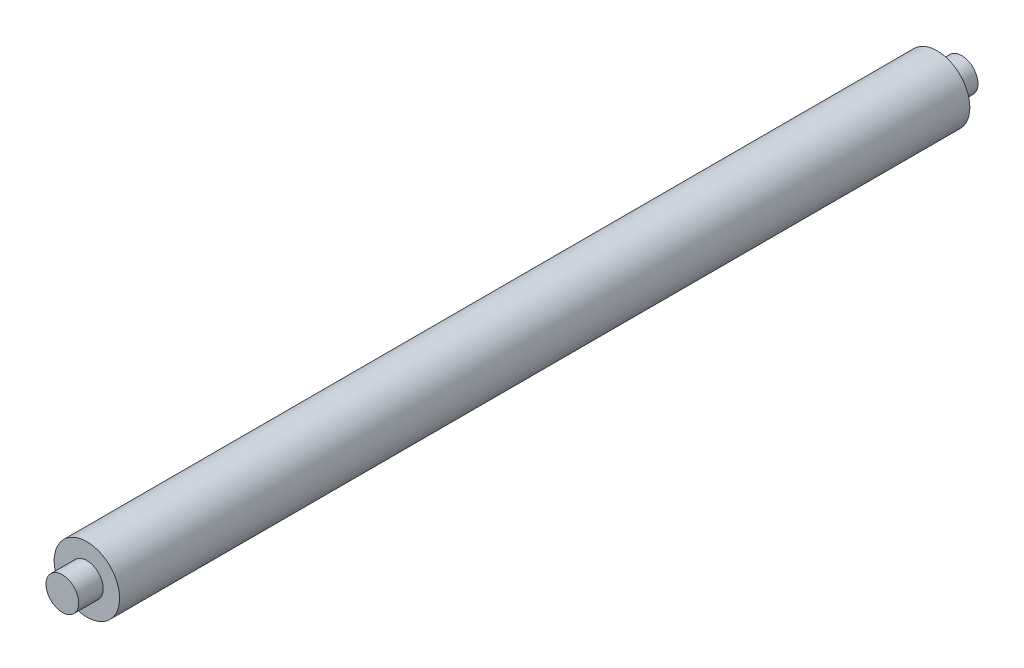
ISO-10303-21;
HEADER;
FILE_DESCRIPTION(('STEP AP214'),'2;1');
FILE_NAME('part.step','',(''),(''),'','','');
FILE_SCHEMA(('AUTOMOTIVE_DESIGN { 1 0 10303 214 1 1 1 1 }'));
ENDSEC;
DATA;
#1=APPLICATION_CONTEXT('core data for automotive mechanical design processes');
#2=APPLICATION_PROTOCOL_DEFINITION('international standard','automotive_design',2000,#1);
#3=PRODUCT_CONTEXT('',#1,'mechanical');
#4=PRODUCT('Part','Part','',(#3));
#5=PRODUCT_RELATED_PRODUCT_CATEGORY('part','',(#4));
#6=PRODUCT_DEFINITION_FORMATION('','',#4);
#7=PRODUCT_DEFINITION_CONTEXT('part definition',#1,'design');
#8=PRODUCT_DEFINITION('design','',#6,#7);
#9=PRODUCT_DEFINITION_SHAPE('','',#8);
#10=(LENGTH_UNIT() NAMED_UNIT(*) SI_UNIT(.MILLI.,.METRE.));
#11=(NAMED_UNIT(*) PLANE_ANGLE_UNIT() SI_UNIT($,.RADIAN.));
#12=(NAMED_UNIT(*) SI_UNIT($,.STERADIAN.) SOLID_ANGLE_UNIT());
#13=UNCERTAINTY_MEASURE_WITH_UNIT(LENGTH_MEASURE(1.E-05),#10,'distance_accuracy_value','');
#14=(GEOMETRIC_REPRESENTATION_CONTEXT(3) GLOBAL_UNCERTAINTY_ASSIGNED_CONTEXT((#13)) GLOBAL_UNIT_ASSIGNED_CONTEXT((#10,
#11,#12)) REPRESENTATION_CONTEXT('',''));
#15=CARTESIAN_POINT('',(0.,0.,0.));
#16=DIRECTION('',(0.,0.,1.));
#17=DIRECTION('',(1.,0.,0.));
#18=AXIS2_PLACEMENT_3D('',#15,#16,#17);
#19=CARTESIAN_POINT('',(1.22124532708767E-12,1.87350135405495E-13,330.2));
#20=DIRECTION('',(0.,0.,1.));
#21=DIRECTION('',(1.00000000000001,0.,0.));
#22=AXIS2_PLACEMENT_3D('',#19,#20,#21);
#23=PLANE('',#22);
#24=CARTESIAN_POINT('',(1.22124532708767E-12,1.87350135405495E-13,330.2));
#25=DIRECTION('',(0.,0.,1.));
#26=DIRECTION('',(1.00000000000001,0.,0.));
#27=AXIS2_PLACEMENT_3D('',#24,#25,#26);
#28=CIRCLE('',#27,25.4);
#29=CARTESIAN_POINT('',(25.4000000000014,1.88760118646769E-13,330.2));
#30=VERTEX_POINT('',#29);
#31=EDGE_CURVE('E10',#30,#30,#28,.T.);
#32=ORIENTED_EDGE('',*,*,#31,.T.);
#33=EDGE_LOOP('',(#32));
#34=FACE_BOUND('',#33,.T.);
#35=CARTESIAN_POINT('',(1.22124532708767E-12,1.87350135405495E-13,330.2));
#36=DIRECTION('',(0.,0.,1.));
#37=DIRECTION('',(1.00000000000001,0.,0.));
#38=AXIS2_PLACEMENT_3D('',#35,#36,#37);
#39=CIRCLE('',#38,12.7);
#40=CARTESIAN_POINT('',(-12.7000000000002,0.,330.2));
#41=VERTEX_POINT('',#40);
#42=EDGE_CURVE('E47',#41,#41,#39,.T.);
#43=ORIENTED_EDGE('',*,*,#42,.F.);
#44=EDGE_LOOP('',(#43));
#45=FACE_BOUND('',#44,.T.);
#46=ADVANCED_FACE('F32',(#34,#45),#23,.T.);
#47=CARTESIAN_POINT('',(1.22124532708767E-12,1.87350135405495E-13,330.2));
#48=DIRECTION('',(0.,0.,-1.));
#49=DIRECTION('',(-1.00000000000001,0.,0.));
#50=AXIS2_PLACEMENT_3D('',#47,#48,#49);
#51=CYLINDRICAL_SURFACE('',#50,25.4);
#52=ORIENTED_EDGE('',*,*,#31,.F.);
#53=EDGE_LOOP('',(#52));
#54=FACE_BOUND('',#53,.T.);
#55=CARTESIAN_POINT('',(-5.55111512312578E-13,0.,-330.2));
#56=DIRECTION('',(0.,0.,1.));
#57=DIRECTION('',(1.00000000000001,0.,0.));
#58=AXIS2_PLACEMENT_3D('',#55,#56,#57);
#59=CIRCLE('',#58,25.4);
#60=CARTESIAN_POINT('',(25.3999999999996,0.,-330.2));
#61=VERTEX_POINT('',#60);
#62=EDGE_CURVE('E39',#61,#61,#59,.T.);
#63=ORIENTED_EDGE('',*,*,#62,.T.);
#64=EDGE_LOOP('',(#63));
#65=FACE_BOUND('',#64,.T.);
#66=ADVANCED_FACE('F34',(#54,#65),#51,.T.);
#67=CARTESIAN_POINT('',(-5.55111512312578E-13,0.,-330.2));
#68=DIRECTION('',(0.,0.,1.));
#69=DIRECTION('',(1.00000000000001,0.,0.));
#70=AXIS2_PLACEMENT_3D('',#67,#68,#69);
#71=PLANE('',#70);
#72=CARTESIAN_POINT('',(-5.55111512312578E-13,0.,-330.2));
#73=DIRECTION('',(0.,0.,1.));
#74=DIRECTION('',(1.00000000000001,0.,0.));
#75=AXIS2_PLACEMENT_3D('',#72,#73,#74);
#76=CIRCLE('',#75,12.7);
#77=CARTESIAN_POINT('',(12.7000000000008,-1.5888956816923E-13,-330.2));
#78=VERTEX_POINT('',#77);
#79=EDGE_CURVE('E55',#78,#78,#76,.T.);
#80=ORIENTED_EDGE('',*,*,#79,.T.);
#81=EDGE_LOOP('',(#80));
#82=FACE_BOUND('',#81,.T.);
#83=ORIENTED_EDGE('',*,*,#62,.F.);
#84=EDGE_LOOP('',(#83));
#85=FACE_BOUND('',#84,.T.);
#86=ADVANCED_FACE('F59',(#82,#85),#71,.F.);
#87=CARTESIAN_POINT('',(-1.11022302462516E-13,0.,349.25));
#88=DIRECTION('',(0.,0.,-1.));
#89=DIRECTION('',(-1.00000000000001,0.,0.));
#90=AXIS2_PLACEMENT_3D('',#87,#88,#89);
#91=CYLINDRICAL_SURFACE('',#90,12.7);
#92=CARTESIAN_POINT('',(-1.11022302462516E-13,0.,349.25));
#93=DIRECTION('',(0.,0.,1.));
#94=DIRECTION('',(1.00000000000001,0.,0.));
#95=AXIS2_PLACEMENT_3D('',#92,#93,#94);
#96=CIRCLE('',#95,12.7);
#97=CARTESIAN_POINT('',(-12.7000000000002,0.,349.25));
#98=VERTEX_POINT('',#97);
#99=EDGE_CURVE('E43',#98,#98,#96,.T.);
#100=CARTESIAN_POINT('',(-12.7000000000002,0.,349.25));
#101=CARTESIAN_POINT('',(-12.7000000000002,0.,349.0515625));
#102=CARTESIAN_POINT('',(-12.7000000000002,0.,348.853125));
#103=CARTESIAN_POINT('',(-12.7000000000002,0.,348.45625));
#104=CARTESIAN_POINT('',(-12.7000000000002,0.,348.2578125));
#105=CARTESIAN_POINT('',(-12.7000000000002,0.,347.8609375));
#106=CARTESIAN_POINT('',(-12.7000000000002,0.,347.6625));
#107=CARTESIAN_POINT('',(-12.7000000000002,0.,347.265625));
#108=CARTESIAN_POINT('',(-12.7000000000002,0.,347.0671875));
#109=CARTESIAN_POINT('',(-12.7000000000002,0.,346.6703125));
#110=CARTESIAN_POINT('',(-12.7000000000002,0.,346.471875));
#111=CARTESIAN_POINT('',(-12.7000000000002,0.,346.075));
#112=CARTESIAN_POINT('',(-12.7000000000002,0.,345.8765625));
#113=CARTESIAN_POINT('',(-12.7000000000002,0.,345.4796875));
#114=CARTESIAN_POINT('',(-12.7000000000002,0.,345.28125));
#115=CARTESIAN_POINT('',(-12.7000000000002,0.,344.884375));
#116=CARTESIAN_POINT('',(-12.7000000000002,0.,344.6859375));
#117=CARTESIAN_POINT('',(-12.7000000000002,0.,344.2890625));
#118=CARTESIAN_POINT('',(-12.7000000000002,0.,344.090625));
#119=CARTESIAN_POINT('',(-12.7000000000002,0.,343.69375));
#120=CARTESIAN_POINT('',(-12.7000000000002,0.,343.4953125));
#121=CARTESIAN_POINT('',(-12.7000000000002,0.,343.0984375));
#122=CARTESIAN_POINT('',(-12.7000000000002,0.,342.9));
#123=CARTESIAN_POINT('',(-12.7000000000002,0.,342.503125));
#124=CARTESIAN_POINT('',(-12.7000000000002,0.,342.3046875));
#125=CARTESIAN_POINT('',(-12.7000000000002,0.,341.9078125));
#126=CARTESIAN_POINT('',(-12.7000000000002,0.,341.709375));
#127=CARTESIAN_POINT('',(-12.7000000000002,0.,341.3125));
#128=CARTESIAN_POINT('',(-12.7000000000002,0.,341.1140625));
#129=CARTESIAN_POINT('',(-12.7000000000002,0.,340.7171875));
#130=CARTESIAN_POINT('',(-12.7000000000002,0.,340.51875));
#131=CARTESIAN_POINT('',(-12.7000000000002,0.,340.121875));
#132=CARTESIAN_POINT('',(-12.7000000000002,0.,339.9234375));
#133=CARTESIAN_POINT('',(-12.7000000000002,0.,339.5265625));
#134=CARTESIAN_POINT('',(-12.7000000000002,0.,339.328125));
#135=CARTESIAN_POINT('',(-12.7000000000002,0.,338.93125));
#136=CARTESIAN_POINT('',(-12.7000000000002,0.,338.7328125));
#137=CARTESIAN_POINT('',(-12.7000000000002,0.,338.3359375));
#138=CARTESIAN_POINT('',(-12.7000000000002,0.,338.1375));
#139=CARTESIAN_POINT('',(-12.7000000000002,0.,337.740625));
#140=CARTESIAN_POINT('',(-12.7000000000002,0.,337.5421875));
#141=CARTESIAN_POINT('',(-12.7000000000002,0.,337.1453125));
#142=CARTESIAN_POINT('',(-12.7000000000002,0.,336.946875));
#143=CARTESIAN_POINT('',(-12.7000000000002,0.,336.55));
#144=CARTESIAN_POINT('',(-12.7000000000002,0.,336.3515625));
#145=CARTESIAN_POINT('',(-12.7000000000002,0.,335.9546875));
#146=CARTESIAN_POINT('',(-12.7000000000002,0.,335.75625));
#147=CARTESIAN_POINT('',(-12.7000000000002,0.,335.359375));
#148=CARTESIAN_POINT('',(-12.7000000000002,0.,335.1609375));
#149=CARTESIAN_POINT('',(-12.7000000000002,0.,334.7640625));
#150=CARTESIAN_POINT('',(-12.7000000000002,0.,334.565625));
#151=CARTESIAN_POINT('',(-12.7000000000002,0.,334.16875));
#152=CARTESIAN_POINT('',(-12.7000000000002,0.,333.9703125));
#153=CARTESIAN_POINT('',(-12.7000000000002,0.,333.5734375));
#154=CARTESIAN_POINT('',(-12.7000000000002,0.,333.375));
#155=CARTESIAN_POINT('',(-12.7000000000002,0.,332.978125));
#156=CARTESIAN_POINT('',(-12.7000000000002,0.,332.7796875));
#157=CARTESIAN_POINT('',(-12.7000000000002,0.,332.3828125));
#158=CARTESIAN_POINT('',(-12.7000000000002,0.,332.184375));
#159=CARTESIAN_POINT('',(-12.7000000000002,0.,331.7875));
#160=CARTESIAN_POINT('',(-12.7000000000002,0.,331.5890625));
#161=CARTESIAN_POINT('',(-12.7000000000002,0.,331.1921875));
#162=CARTESIAN_POINT('',(-12.7000000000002,0.,330.99375));
#163=CARTESIAN_POINT('',(-12.7000000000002,0.,330.596875));
#164=CARTESIAN_POINT('',(-12.7000000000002,0.,330.3984375));
#165=CARTESIAN_POINT('',(-12.7000000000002,0.,330.2));
#166=B_SPLINE_CURVE_WITH_KNOTS('',3,(#100,#101,#102,#103,#104,#105,#106,#107,#108,#109,#110,
#111,#112,#113,#114,#115,#116,#117,#118,#119,#120,#121,#122,#123,#124,#125,#126,#127,#128,#129,
#130,#131,#132,#133,#134,#135,#136,#137,#138,#139,#140,#141,#142,#143,#144,#145,#146,#147,#148,
#149,#150,#151,#152,#153,#154,#155,#156,#157,#158,#159,#160,#161,#162,#163,#164,#165),
.UNSPECIFIED.,.F.,.F.,(4,2,2,2,2,2,2,2,2,2,2,2,2,2,2,2,2,2,2,2,2,2,2,2,2,2,2,2,2,2,2,2,4),(0.,
0.595312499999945,1.19062499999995,1.78593749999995,2.38124999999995,2.97656249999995,
3.57187499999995,4.16718749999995,4.76249999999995,5.35781249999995,5.95312499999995,
6.54843749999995,7.14374999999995,7.73906249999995,8.33437499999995,8.92968749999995,
9.52499999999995,10.1203125,10.715625,11.3109375,11.90625,12.5015625,13.096875,13.6921875,
14.2875,14.8828125,15.478125,16.0734375,16.66875,17.2640625,17.859375,18.4546875,19.05),.UNSPECIFIED.);
#167=EDGE_CURVE('BSEAM74',#98,#41,#166,.T.);
#168=ORIENTED_EDGE('',*,*,#99,.F.);
#169=ORIENTED_EDGE('',*,*,#42,.T.);
#170=ORIENTED_EDGE('',*,*,#167,.T.);
#171=ORIENTED_EDGE('',*,*,#167,.F.);
#172=EDGE_LOOP('',(#168,#170,#169,#171));
#173=FACE_BOUND('',#172,.T.);
#174=ADVANCED_FACE('F74',(#173),#91,.T.);
#175=CARTESIAN_POINT('',(-1.11022302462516E-13,0.,349.25));
#176=DIRECTION('',(0.,0.,1.));
#177=DIRECTION('',(1.00000000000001,0.,0.));
#178=AXIS2_PLACEMENT_3D('',#175,#176,#177);
#179=PLANE('',#178);
#180=ORIENTED_EDGE('',*,*,#99,.T.);
#181=EDGE_LOOP('',(#180));
#182=FACE_BOUND('',#181,.T.);
#183=ADVANCED_FACE('F65',(#182),#179,.T.);
#184=CARTESIAN_POINT('',(6.66133814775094E-13,-1.59594559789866E-13,-349.25));
#185=DIRECTION('',(0.,0.,1.));
#186=DIRECTION('',(1.00000000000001,0.,0.));
#187=AXIS2_PLACEMENT_3D('',#184,#185,#186);
#188=CYLINDRICAL_SURFACE('',#187,12.7);
#189=CARTESIAN_POINT('',(6.66133814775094E-13,-1.59594559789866E-13,-349.25));
#190=DIRECTION('',(0.,0.,1.));
#191=DIRECTION('',(1.00000000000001,0.,0.));
#192=AXIS2_PLACEMENT_3D('',#189,#190,#191);
#193=CIRCLE('',#192,12.7);
#194=CARTESIAN_POINT('',(12.7000000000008,-1.58889568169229E-13,-349.25));
#195=VERTEX_POINT('',#194);
#196=EDGE_CURVE('E52',#195,#195,#193,.T.);
#197=CARTESIAN_POINT('',(12.7000000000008,-1.58889568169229E-13,-349.25));
#198=CARTESIAN_POINT('',(12.7000000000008,-1.58889568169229E-13,-349.0515625));
#199=CARTESIAN_POINT('',(12.7000000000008,-1.58889568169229E-13,-348.853125));
#200=CARTESIAN_POINT('',(12.7000000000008,-1.58889568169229E-13,-348.45625));
#201=CARTESIAN_POINT('',(12.7000000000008,-1.58889568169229E-13,-348.2578125));
#202=CARTESIAN_POINT('',(12.7000000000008,-1.58889568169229E-13,-347.8609375));
#203=CARTESIAN_POINT('',(12.7000000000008,-1.58889568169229E-13,-347.6625));
#204=CARTESIAN_POINT('',(12.7000000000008,-1.58889568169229E-13,-347.265625));
#205=CARTESIAN_POINT('',(12.7000000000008,-1.58889568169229E-13,-347.0671875));
#206=CARTESIAN_POINT('',(12.7000000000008,-1.58889568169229E-13,-346.6703125));
#207=CARTESIAN_POINT('',(12.7000000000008,-1.58889568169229E-13,-346.471875));
#208=CARTESIAN_POINT('',(12.7000000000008,-1.58889568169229E-13,-346.075));
#209=CARTESIAN_POINT('',(12.7000000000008,-1.58889568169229E-13,-345.8765625));
#210=CARTESIAN_POINT('',(12.7000000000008,-1.58889568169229E-13,-345.4796875));
#211=CARTESIAN_POINT('',(12.7000000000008,-1.58889568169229E-13,-345.28125));
#212=CARTESIAN_POINT('',(12.7000000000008,-1.58889568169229E-13,-344.884375));
#213=CARTESIAN_POINT('',(12.7000000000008,-1.58889568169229E-13,-344.6859375));
#214=CARTESIAN_POINT('',(12.7000000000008,-1.58889568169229E-13,-344.2890625));
#215=CARTESIAN_POINT('',(12.7000000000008,-1.58889568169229E-13,-344.090625));
#216=CARTESIAN_POINT('',(12.7000000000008,-1.58889568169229E-13,-343.69375));
#217=CARTESIAN_POINT('',(12.7000000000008,-1.58889568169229E-13,-343.4953125));
#218=CARTESIAN_POINT('',(12.7000000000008,-1.58889568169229E-13,-343.0984375));
#219=CARTESIAN_POINT('',(12.7000000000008,-1.58889568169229E-13,-342.9));
#220=CARTESIAN_POINT('',(12.7000000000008,-1.58889568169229E-13,-342.503125));
#221=CARTESIAN_POINT('',(12.7000000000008,-1.58889568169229E-13,-342.3046875));
#222=CARTESIAN_POINT('',(12.7000000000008,-1.58889568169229E-13,-341.9078125));
#223=CARTESIAN_POINT('',(12.7000000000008,-1.58889568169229E-13,-341.709375));
#224=CARTESIAN_POINT('',(12.7000000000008,-1.58889568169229E-13,-341.3125));
#225=CARTESIAN_POINT('',(12.7000000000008,-1.58889568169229E-13,-341.1140625));
#226=CARTESIAN_POINT('',(12.7000000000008,-1.58889568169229E-13,-340.7171875));
#227=CARTESIAN_POINT('',(12.7000000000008,-1.5888956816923E-13,-340.51875));
#228=CARTESIAN_POINT('',(12.7000000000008,-1.5888956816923E-13,-340.121875));
#229=CARTESIAN_POINT('',(12.7000000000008,-1.5888956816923E-13,-339.9234375));
#230=CARTESIAN_POINT('',(12.7000000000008,-1.5888956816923E-13,-339.5265625));
#231=CARTESIAN_POINT('',(12.7000000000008,-1.5888956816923E-13,-339.328125));
#232=CARTESIAN_POINT('',(12.7000000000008,-1.5888956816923E-13,-338.93125));
#233=CARTESIAN_POINT('',(12.7000000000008,-1.5888956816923E-13,-338.7328125));
#234=CARTESIAN_POINT('',(12.7000000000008,-1.5888956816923E-13,-338.3359375));
#235=CARTESIAN_POINT('',(12.7000000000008,-1.5888956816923E-13,-338.1375));
#236=CARTESIAN_POINT('',(12.7000000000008,-1.5888956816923E-13,-337.740625));
#237=CARTESIAN_POINT('',(12.7000000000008,-1.5888956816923E-13,-337.5421875));
#238=CARTESIAN_POINT('',(12.7000000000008,-1.5888956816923E-13,-337.1453125));
#239=CARTESIAN_POINT('',(12.7000000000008,-1.5888956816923E-13,-336.946875));
#240=CARTESIAN_POINT('',(12.7000000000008,-1.5888956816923E-13,-336.55));
#241=CARTESIAN_POINT('',(12.7000000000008,-1.5888956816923E-13,-336.3515625));
#242=CARTESIAN_POINT('',(12.7000000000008,-1.5888956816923E-13,-335.9546875));
#243=CARTESIAN_POINT('',(12.7000000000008,-1.5888956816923E-13,-335.75625));
#244=CARTESIAN_POINT('',(12.7000000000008,-1.5888956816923E-13,-335.359375));
#245=CARTESIAN_POINT('',(12.7000000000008,-1.5888956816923E-13,-335.1609375));
#246=CARTESIAN_POINT('',(12.7000000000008,-1.5888956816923E-13,-334.7640625));
#247=CARTESIAN_POINT('',(12.7000000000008,-1.5888956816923E-13,-334.565625));
#248=CARTESIAN_POINT('',(12.7000000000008,-1.5888956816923E-13,-334.16875));
#249=CARTESIAN_POINT('',(12.7000000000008,-1.5888956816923E-13,-333.9703125));
#250=CARTESIAN_POINT('',(12.7000000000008,-1.5888956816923E-13,-333.5734375));
#251=CARTESIAN_POINT('',(12.7000000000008,-1.5888956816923E-13,-333.375));
#252=CARTESIAN_POINT('',(12.7000000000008,-1.5888956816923E-13,-332.978125));
#253=CARTESIAN_POINT('',(12.7000000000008,-1.5888956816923E-13,-332.7796875));
#254=CARTESIAN_POINT('',(12.7000000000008,-1.5888956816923E-13,-332.3828125));
#255=CARTESIAN_POINT('',(12.7000000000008,-1.5888956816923E-13,-332.184375));
#256=CARTESIAN_POINT('',(12.7000000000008,-1.5888956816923E-13,-331.7875));
#257=CARTESIAN_POINT('',(12.7000000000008,-1.5888956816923E-13,-331.5890625));
#258=CARTESIAN_POINT('',(12.7000000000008,-1.5888956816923E-13,-331.1921875));
#259=CARTESIAN_POINT('',(12.7000000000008,-1.5888956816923E-13,-330.99375));
#260=CARTESIAN_POINT('',(12.7000000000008,-1.5888956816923E-13,-330.596875));
#261=CARTESIAN_POINT('',(12.7000000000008,-1.5888956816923E-13,-330.3984375));
#262=CARTESIAN_POINT('',(12.7000000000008,-1.5888956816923E-13,-330.2));
#263=B_SPLINE_CURVE_WITH_KNOTS('',3,(#197,#198,#199,#200,#201,#202,#203,#204,#205,#206,#207,
#208,#209,#210,#211,#212,#213,#214,#215,#216,#217,#218,#219,#220,#221,#222,#223,#224,#225,#226,
#227,#228,#229,#230,#231,#232,#233,#234,#235,#236,#237,#238,#239,#240,#241,#242,#243,#244,#245,
#246,#247,#248,#249,#250,#251,#252,#253,#254,#255,#256,#257,#258,#259,#260,#261,#262),
.UNSPECIFIED.,.F.,.F.,(4,2,2,2,2,2,2,2,2,2,2,2,2,2,2,2,2,2,2,2,2,2,2,2,2,2,2,2,2,2,2,2,4),(0.,
0.595312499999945,1.19062499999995,1.78593749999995,2.38124999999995,2.97656249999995,
3.57187499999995,4.16718749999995,4.76249999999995,5.35781249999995,5.95312499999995,
6.54843749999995,7.14374999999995,7.73906249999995,8.33437499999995,8.92968749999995,
9.52499999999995,10.1203125,10.715625,11.3109375,11.90625,12.5015625,13.096875,13.6921875,
14.2875,14.8828125,15.478125,16.0734375,16.66875,17.2640625,17.859375,18.4546875,19.05),.UNSPECIFIED.);
#264=EDGE_CURVE('BSEAM62',#195,#78,#263,.T.);
#265=ORIENTED_EDGE('',*,*,#196,.T.);
#266=ORIENTED_EDGE('',*,*,#79,.F.);
#267=ORIENTED_EDGE('',*,*,#264,.T.);
#268=ORIENTED_EDGE('',*,*,#264,.F.);
#269=EDGE_LOOP('',(#265,#267,#266,#268));
#270=FACE_BOUND('',#269,.T.);
#271=ADVANCED_FACE('F62',(#270),#188,.T.);
#272=CARTESIAN_POINT('',(6.66133814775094E-13,-1.59594559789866E-13,-349.25));
#273=DIRECTION('',(0.,0.,1.));
#274=DIRECTION('',(1.00000000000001,0.,0.));
#275=AXIS2_PLACEMENT_3D('',#272,#273,#274);
#276=PLANE('',#275);
#277=ORIENTED_EDGE('',*,*,#196,.F.);
#278=EDGE_LOOP('',(#277));
#279=FACE_BOUND('',#278,.T.);
#280=ADVANCED_FACE('F64',(#279),#276,.F.);
#281=CLOSED_SHELL('',(#46,#66,#86,#174,#183,#271,#280));
#282=MANIFOLD_SOLID_BREP('B2',#281);
#283=ADVANCED_BREP_SHAPE_REPRESENTATION('',(#18,#282),#14);
#284=SHAPE_DEFINITION_REPRESENTATION(#9,#283);
ENDSEC;
END-ISO-10303-21;
